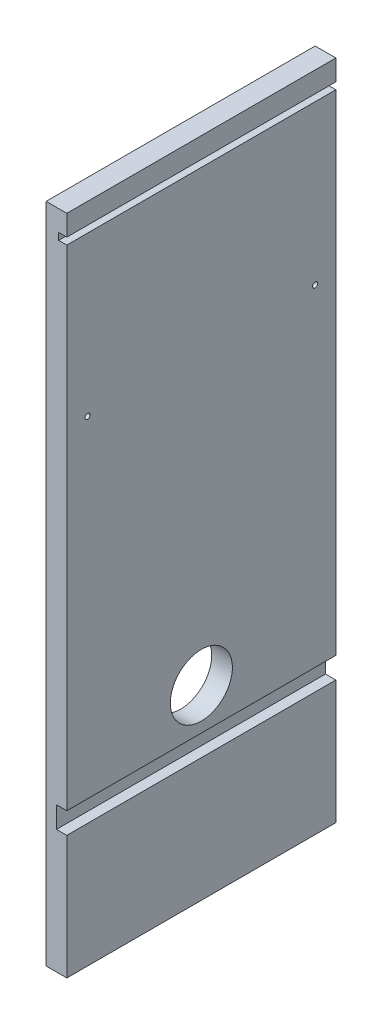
ISO-10303-21;
HEADER;
FILE_DESCRIPTION(('STEP AP214'),'2;1');
FILE_NAME('part.step','',(''),(''),'','','');
FILE_SCHEMA(('AUTOMOTIVE_DESIGN { 1 0 10303 214 1 1 1 1 }'));
ENDSEC;
DATA;
#1=APPLICATION_CONTEXT('core data for automotive mechanical design processes');
#2=APPLICATION_PROTOCOL_DEFINITION('international standard','automotive_design',2000,#1);
#3=PRODUCT_CONTEXT('',#1,'mechanical');
#4=PRODUCT('Part','Part','',(#3));
#5=PRODUCT_RELATED_PRODUCT_CATEGORY('part','',(#4));
#6=PRODUCT_DEFINITION_FORMATION('','',#4);
#7=PRODUCT_DEFINITION_CONTEXT('part definition',#1,'design');
#8=PRODUCT_DEFINITION('design','',#6,#7);
#9=PRODUCT_DEFINITION_SHAPE('','',#8);
#10=(LENGTH_UNIT() NAMED_UNIT(*) SI_UNIT(.MILLI.,.METRE.));
#11=(NAMED_UNIT(*) PLANE_ANGLE_UNIT() SI_UNIT($,.RADIAN.));
#12=(NAMED_UNIT(*) SI_UNIT($,.STERADIAN.) SOLID_ANGLE_UNIT());
#13=UNCERTAINTY_MEASURE_WITH_UNIT(LENGTH_MEASURE(1.E-05),#10,'distance_accuracy_value','');
#14=(GEOMETRIC_REPRESENTATION_CONTEXT(3) GLOBAL_UNCERTAINTY_ASSIGNED_CONTEXT((#13)) GLOBAL_UNIT_ASSIGNED_CONTEXT((#10,
#11,#12)) REPRESENTATION_CONTEXT('',''));
#15=CARTESIAN_POINT('',(0.,0.,0.));
#16=DIRECTION('',(0.,0.,1.));
#17=DIRECTION('',(1.,0.,0.));
#18=AXIS2_PLACEMENT_3D('',#15,#16,#17);
#19=CARTESIAN_POINT('',(-26.846079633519,0.,130.));
#20=DIRECTION('',(1.,0.,0.));
#21=DIRECTION('',(0.,1.,0.));
#22=AXIS2_PLACEMENT_3D('',#19,#20,#21);
#23=PLANE('',#22);
#24=CARTESIAN_POINT('',(-26.846079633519,-90.,120.));
#25=DIRECTION('',(-1.,0.,0.));
#26=DIRECTION('',(0.,-1.,0.));
#27=AXIS2_PLACEMENT_3D('',#24,#25,#26);
#28=CIRCLE('',#27,1.25000000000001);
#29=CARTESIAN_POINT('',(-26.846079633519,-91.25,120.));
#30=VERTEX_POINT('',#29);
#31=EDGE_CURVE('E276',#30,#30,#28,.T.);
#32=ORIENTED_EDGE('',*,*,#31,.F.);
#33=EDGE_LOOP('',(#32));
#34=FACE_BOUND('',#33,.T.);
#35=CARTESIAN_POINT('',(-26.846079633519,-90.,9.99999999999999));
#36=DIRECTION('',(-1.,0.,0.));
#37=DIRECTION('',(0.,-1.,0.));
#38=AXIS2_PLACEMENT_3D('',#35,#36,#37);
#39=CIRCLE('',#38,1.25);
#40=CARTESIAN_POINT('',(-26.846079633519,-91.25,9.99999999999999));
#41=VERTEX_POINT('',#40);
#42=EDGE_CURVE('E280',#41,#41,#39,.T.);
#43=ORIENTED_EDGE('',*,*,#42,.F.);
#44=EDGE_LOOP('',(#43));
#45=FACE_BOUND('',#44,.T.);
#46=CARTESIAN_POINT('',(-26.846079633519,-230.,65.));
#47=DIRECTION('',(-1.,0.,0.));
#48=DIRECTION('',(0.,-1.,0.));
#49=AXIS2_PLACEMENT_3D('',#46,#47,#48);
#50=CIRCLE('',#49,15.);
#51=CARTESIAN_POINT('',(-26.846079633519,-245.,65.));
#52=VERTEX_POINT('',#51);
#53=EDGE_CURVE('E144',#52,#52,#50,.T.);
#54=ORIENTED_EDGE('',*,*,#53,.F.);
#55=EDGE_LOOP('',(#54));
#56=FACE_BOUND('',#55,.T.);
#57=DIRECTION('',(0.,-1.,0.));
#58=VECTOR('',#57,1.);
#59=CARTESIAN_POINT('',(-26.846079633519,0.,0.));
#60=LINE('',#59,#58);
#61=CARTESIAN_POINT('',(-26.846079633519,0.,0.));
#62=VERTEX_POINT('',#61);
#63=CARTESIAN_POINT('',(-26.846079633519,-320.,0.));
#64=VERTEX_POINT('',#63);
#65=EDGE_CURVE('E127',#62,#64,#60,.T.);
#66=ORIENTED_EDGE('',*,*,#65,.T.);
#67=DIRECTION('',(0.,0.,-1.));
#68=VECTOR('',#67,1.);
#69=CARTESIAN_POINT('',(-26.846079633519,-320.,130.));
#70=LINE('',#69,#68);
#71=CARTESIAN_POINT('',(-26.846079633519,-320.,130.));
#72=VERTEX_POINT('',#71);
#73=EDGE_CURVE('E11',#72,#64,#70,.T.);
#74=ORIENTED_EDGE('',*,*,#73,.F.);
#75=DIRECTION('',(0.,-1.,0.));
#76=VECTOR('',#75,1.);
#77=CARTESIAN_POINT('',(-26.846079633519,0.,130.));
#78=LINE('',#77,#76);
#79=CARTESIAN_POINT('',(-26.846079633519,0.,130.));
#80=VERTEX_POINT('',#79);
#81=EDGE_CURVE('E167',#80,#72,#78,.T.);
#82=ORIENTED_EDGE('',*,*,#81,.F.);
#83=DIRECTION('',(0.,0.,-1.));
#84=VECTOR('',#83,1.);
#85=CARTESIAN_POINT('',(-26.846079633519,0.,130.));
#86=LINE('',#85,#84);
#87=EDGE_CURVE('E140',#80,#62,#86,.T.);
#88=ORIENTED_EDGE('',*,*,#87,.T.);
#89=EDGE_LOOP('',(#66,#74,#82,#88));
#90=FACE_BOUND('',#89,.T.);
#91=ADVANCED_FACE('F35',(#34,#45,#56,#90),#23,.F.);
#92=CARTESIAN_POINT('',(-26.846079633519,-320.,130.));
#93=DIRECTION('',(0.,1.,0.));
#94=DIRECTION('',(0.,0.,1.));
#95=AXIS2_PLACEMENT_3D('',#92,#93,#94);
#96=PLANE('',#95);
#97=CARTESIAN_POINT('',(-21.4686115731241,-320.,65.));
#98=DIRECTION('',(0.,-1.,0.));
#99=DIRECTION('',(0.,0.,-1.));
#100=AXIS2_PLACEMENT_3D('',#97,#98,#99);
#101=CIRCLE('',#100,2.5);
#102=CARTESIAN_POINT('',(-21.4686115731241,-320.,62.5));
#103=VERTEX_POINT('',#102);
#104=EDGE_CURVE('E296',#103,#103,#101,.T.);
#105=ORIENTED_EDGE('',*,*,#104,.F.);
#106=EDGE_LOOP('',(#105));
#107=FACE_BOUND('',#106,.T.);
#108=DIRECTION('',(1.,0.,0.));
#109=VECTOR('',#108,1.);
#110=CARTESIAN_POINT('',(-26.846079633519,-320.,0.));
#111=LINE('',#110,#109);
#112=CARTESIAN_POINT('',(-16.846079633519,-320.,0.));
#113=VERTEX_POINT('',#112);
#114=EDGE_CURVE('E123',#64,#113,#111,.T.);
#115=ORIENTED_EDGE('',*,*,#114,.T.);
#116=DIRECTION('',(0.,0.,-1.));
#117=VECTOR('',#116,1.);
#118=CARTESIAN_POINT('',(-16.846079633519,-320.,130.));
#119=LINE('',#118,#117);
#120=CARTESIAN_POINT('',(-16.846079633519,-320.,130.));
#121=VERTEX_POINT('',#120);
#122=EDGE_CURVE('E42',#121,#113,#119,.T.);
#123=ORIENTED_EDGE('',*,*,#122,.F.);
#124=DIRECTION('',(1.,0.,0.));
#125=VECTOR('',#124,1.);
#126=CARTESIAN_POINT('',(-26.846079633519,-320.,130.));
#127=LINE('',#126,#125);
#128=EDGE_CURVE('E136',#72,#121,#127,.T.);
#129=ORIENTED_EDGE('',*,*,#128,.F.);
#130=ORIENTED_EDGE('',*,*,#73,.T.);
#131=EDGE_LOOP('',(#115,#123,#129,#130));
#132=FACE_BOUND('',#131,.T.);
#133=ADVANCED_FACE('F135',(#107,#132),#96,.F.);
#134=CARTESIAN_POINT('',(-16.846079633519,-260.3,130.));
#135=DIRECTION('',(-1.,0.,0.));
#136=DIRECTION('',(0.,-1.,0.));
#137=AXIS2_PLACEMENT_3D('',#134,#135,#136);
#138=PLANE('',#137);
#139=DIRECTION('',(0.,1.,0.));
#140=VECTOR('',#139,1.);
#141=CARTESIAN_POINT('',(-16.846079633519,-260.3,0.));
#142=LINE('',#141,#140);
#143=CARTESIAN_POINT('',(-16.846079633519,-260.3,0.));
#144=VERTEX_POINT('',#143);
#145=EDGE_CURVE('E129',#113,#144,#142,.T.);
#146=ORIENTED_EDGE('',*,*,#145,.T.);
#147=DIRECTION('',(0.,0.,-1.));
#148=VECTOR('',#147,1.);
#149=CARTESIAN_POINT('',(-16.846079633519,-260.3,130.));
#150=LINE('',#149,#148);
#151=CARTESIAN_POINT('',(-16.846079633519,-260.3,130.));
#152=VERTEX_POINT('',#151);
#153=EDGE_CURVE('E213',#152,#144,#150,.T.);
#154=ORIENTED_EDGE('',*,*,#153,.F.);
#155=DIRECTION('',(0.,1.,0.));
#156=VECTOR('',#155,1.);
#157=CARTESIAN_POINT('',(-16.846079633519,-260.3,130.));
#158=LINE('',#157,#156);
#159=EDGE_CURVE('E170',#121,#152,#158,.T.);
#160=ORIENTED_EDGE('',*,*,#159,.F.);
#161=ORIENTED_EDGE('',*,*,#122,.T.);
#162=EDGE_LOOP('',(#146,#154,#160,#161));
#163=FACE_BOUND('',#162,.T.);
#164=ADVANCED_FACE('F217',(#163),#138,.F.);
#165=CARTESIAN_POINT('',(-16.846079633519,-260.3,130.));
#166=DIRECTION('',(0.,-1.,0.));
#167=DIRECTION('',(0.,0.,-1.));
#168=AXIS2_PLACEMENT_3D('',#165,#166,#167);
#169=PLANE('',#168);
#170=DIRECTION('',(-1.,0.,0.));
#171=VECTOR('',#170,1.);
#172=CARTESIAN_POINT('',(-16.846079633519,-260.3,0.));
#173=LINE('',#172,#171);
#174=CARTESIAN_POINT('',(-21.8460796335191,-260.3,0.));
#175=VERTEX_POINT('',#174);
#176=EDGE_CURVE('E149',#144,#175,#173,.T.);
#177=ORIENTED_EDGE('',*,*,#176,.T.);
#178=DIRECTION('',(0.,0.,-1.));
#179=VECTOR('',#178,1.);
#180=CARTESIAN_POINT('',(-21.8460796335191,-260.3,130.));
#181=LINE('',#180,#179);
#182=CARTESIAN_POINT('',(-21.8460796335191,-260.3,130.));
#183=VERTEX_POINT('',#182);
#184=EDGE_CURVE('E210',#183,#175,#181,.T.);
#185=ORIENTED_EDGE('',*,*,#184,.F.);
#186=DIRECTION('',(-1.,0.,0.));
#187=VECTOR('',#186,1.);
#188=CARTESIAN_POINT('',(-16.846079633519,-260.3,130.));
#189=LINE('',#188,#187);
#190=EDGE_CURVE('E172',#152,#183,#189,.T.);
#191=ORIENTED_EDGE('',*,*,#190,.F.);
#192=ORIENTED_EDGE('',*,*,#153,.T.);
#193=EDGE_LOOP('',(#177,#185,#191,#192));
#194=FACE_BOUND('',#193,.T.);
#195=ADVANCED_FACE('F225',(#194),#169,.F.);
#196=CARTESIAN_POINT('',(-21.8460796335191,-250.,130.));
#197=DIRECTION('',(-1.,0.,0.));
#198=DIRECTION('',(0.,0.,1.));
#199=AXIS2_PLACEMENT_3D('',#196,#197,#198);
#200=PLANE('',#199);
#201=DIRECTION('',(0.,1.,0.));
#202=VECTOR('',#201,1.);
#203=CARTESIAN_POINT('',(-21.8460796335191,-250.,0.));
#204=LINE('',#203,#202);
#205=CARTESIAN_POINT('',(-21.8460796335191,-250.,0.));
#206=VERTEX_POINT('',#205);
#207=EDGE_CURVE('E151',#175,#206,#204,.T.);
#208=ORIENTED_EDGE('',*,*,#207,.T.);
#209=DIRECTION('',(0.,0.,-1.));
#210=VECTOR('',#209,1.);
#211=CARTESIAN_POINT('',(-21.8460796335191,-250.,130.));
#212=LINE('',#211,#210);
#213=CARTESIAN_POINT('',(-21.8460796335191,-250.,130.));
#214=VERTEX_POINT('',#213);
#215=EDGE_CURVE('E207',#214,#206,#212,.T.);
#216=ORIENTED_EDGE('',*,*,#215,.F.);
#217=DIRECTION('',(0.,1.,0.));
#218=VECTOR('',#217,1.);
#219=CARTESIAN_POINT('',(-21.8460796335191,-250.,130.));
#220=LINE('',#219,#218);
#221=EDGE_CURVE('E174',#183,#214,#220,.T.);
#222=ORIENTED_EDGE('',*,*,#221,.F.);
#223=ORIENTED_EDGE('',*,*,#184,.T.);
#224=EDGE_LOOP('',(#208,#216,#222,#223));
#225=FACE_BOUND('',#224,.T.);
#226=ADVANCED_FACE('F228',(#225),#200,.F.);
#227=CARTESIAN_POINT('',(-16.8460796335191,-250.,130.));
#228=DIRECTION('',(0.,1.,0.));
#229=DIRECTION('',(0.,0.,1.));
#230=AXIS2_PLACEMENT_3D('',#227,#228,#229);
#231=PLANE('',#230);
#232=DIRECTION('',(1.,0.,0.));
#233=VECTOR('',#232,1.);
#234=CARTESIAN_POINT('',(-16.8460796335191,-250.,0.));
#235=LINE('',#234,#233);
#236=CARTESIAN_POINT('',(-16.8460796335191,-250.,0.));
#237=VERTEX_POINT('',#236);
#238=EDGE_CURVE('E153',#206,#237,#235,.T.);
#239=ORIENTED_EDGE('',*,*,#238,.T.);
#240=DIRECTION('',(0.,0.,-1.));
#241=VECTOR('',#240,1.);
#242=CARTESIAN_POINT('',(-16.8460796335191,-250.,130.));
#243=LINE('',#242,#241);
#244=CARTESIAN_POINT('',(-16.8460796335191,-250.,130.));
#245=VERTEX_POINT('',#244);
#246=EDGE_CURVE('E204',#245,#237,#243,.T.);
#247=ORIENTED_EDGE('',*,*,#246,.F.);
#248=DIRECTION('',(1.,0.,0.));
#249=VECTOR('',#248,1.);
#250=CARTESIAN_POINT('',(-16.8460796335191,-250.,130.));
#251=LINE('',#250,#249);
#252=EDGE_CURVE('E176',#214,#245,#251,.T.);
#253=ORIENTED_EDGE('',*,*,#252,.F.);
#254=ORIENTED_EDGE('',*,*,#215,.T.);
#255=EDGE_LOOP('',(#239,#247,#253,#254));
#256=FACE_BOUND('',#255,.T.);
#257=ADVANCED_FACE('F233',(#256),#231,.F.);
#258=CARTESIAN_POINT('',(-16.8460796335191,-13.3,130.));
#259=DIRECTION('',(-1.,0.,0.));
#260=DIRECTION('',(0.,-1.,0.));
#261=AXIS2_PLACEMENT_3D('',#258,#259,#260);
#262=PLANE('',#261);
#263=CARTESIAN_POINT('',(-16.846079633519,-90.,120.));
#264=DIRECTION('',(-1.,0.,0.));
#265=DIRECTION('',(0.,-1.,0.));
#266=AXIS2_PLACEMENT_3D('',#263,#264,#265);
#267=CIRCLE('',#266,1.25000000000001);
#268=CARTESIAN_POINT('',(-16.846079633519,-91.25,120.));
#269=VERTEX_POINT('',#268);
#270=EDGE_CURVE('E289',#269,#269,#267,.T.);
#271=ORIENTED_EDGE('',*,*,#270,.T.);
#272=EDGE_LOOP('',(#271));
#273=FACE_BOUND('',#272,.T.);
#274=CARTESIAN_POINT('',(-16.846079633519,-90.,9.99999999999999));
#275=DIRECTION('',(-1.,0.,0.));
#276=DIRECTION('',(0.,-1.,0.));
#277=AXIS2_PLACEMENT_3D('',#274,#275,#276);
#278=CIRCLE('',#277,1.25);
#279=CARTESIAN_POINT('',(-16.846079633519,-91.25,9.99999999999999));
#280=VERTEX_POINT('',#279);
#281=EDGE_CURVE('E284',#280,#280,#278,.T.);
#282=ORIENTED_EDGE('',*,*,#281,.T.);
#283=EDGE_LOOP('',(#282));
#284=FACE_BOUND('',#283,.T.);
#285=CARTESIAN_POINT('',(-16.846079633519,-230.,65.));
#286=DIRECTION('',(-1.,0.,0.));
#287=DIRECTION('',(0.,-1.,0.));
#288=AXIS2_PLACEMENT_3D('',#285,#286,#287);
#289=CIRCLE('',#288,15.);
#290=CARTESIAN_POINT('',(-16.846079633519,-245.,65.));
#291=VERTEX_POINT('',#290);
#292=EDGE_CURVE('E141',#291,#291,#289,.T.);
#293=ORIENTED_EDGE('',*,*,#292,.T.);
#294=EDGE_LOOP('',(#293));
#295=FACE_BOUND('',#294,.T.);
#296=DIRECTION('',(0.,1.,0.));
#297=VECTOR('',#296,1.);
#298=CARTESIAN_POINT('',(-16.8460796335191,-13.3,0.));
#299=LINE('',#298,#297);
#300=CARTESIAN_POINT('',(-16.8460796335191,-13.3,0.));
#301=VERTEX_POINT('',#300);
#302=EDGE_CURVE('E155',#237,#301,#299,.T.);
#303=ORIENTED_EDGE('',*,*,#302,.T.);
#304=DIRECTION('',(0.,0.,-1.));
#305=VECTOR('',#304,1.);
#306=CARTESIAN_POINT('',(-16.8460796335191,-13.3,130.));
#307=LINE('',#306,#305);
#308=CARTESIAN_POINT('',(-16.8460796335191,-13.3,130.));
#309=VERTEX_POINT('',#308);
#310=EDGE_CURVE('E201',#309,#301,#307,.T.);
#311=ORIENTED_EDGE('',*,*,#310,.F.);
#312=DIRECTION('',(0.,1.,0.));
#313=VECTOR('',#312,1.);
#314=CARTESIAN_POINT('',(-16.8460796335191,-13.3,130.));
#315=LINE('',#314,#313);
#316=EDGE_CURVE('E178',#245,#309,#315,.T.);
#317=ORIENTED_EDGE('',*,*,#316,.F.);
#318=ORIENTED_EDGE('',*,*,#246,.T.);
#319=EDGE_LOOP('',(#303,#311,#317,#318));
#320=FACE_BOUND('',#319,.T.);
#321=ADVANCED_FACE('F239',(#273,#284,#295,#320),#262,.F.);
#322=CARTESIAN_POINT('',(-20.7739022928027,-13.3,130.));
#323=DIRECTION('',(0.,-1.,0.));
#324=DIRECTION('',(0.,0.,-1.));
#325=AXIS2_PLACEMENT_3D('',#322,#323,#324);
#326=PLANE('',#325);
#327=DIRECTION('',(-1.,0.,0.));
#328=VECTOR('',#327,1.);
#329=CARTESIAN_POINT('',(-20.7739022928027,-13.3,0.));
#330=LINE('',#329,#328);
#331=CARTESIAN_POINT('',(-20.7739022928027,-13.3,0.));
#332=VERTEX_POINT('',#331);
#333=EDGE_CURVE('E157',#301,#332,#330,.T.);
#334=ORIENTED_EDGE('',*,*,#333,.T.);
#335=DIRECTION('',(0.,0.,-1.));
#336=VECTOR('',#335,1.);
#337=CARTESIAN_POINT('',(-20.7739022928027,-13.3,130.));
#338=LINE('',#337,#336);
#339=CARTESIAN_POINT('',(-20.7739022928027,-13.3,130.));
#340=VERTEX_POINT('',#339);
#341=EDGE_CURVE('E198',#340,#332,#338,.T.);
#342=ORIENTED_EDGE('',*,*,#341,.F.);
#343=DIRECTION('',(-1.,0.,0.));
#344=VECTOR('',#343,1.);
#345=CARTESIAN_POINT('',(-20.7739022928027,-13.3,130.));
#346=LINE('',#345,#344);
#347=EDGE_CURVE('E180',#309,#340,#346,.T.);
#348=ORIENTED_EDGE('',*,*,#347,.F.);
#349=ORIENTED_EDGE('',*,*,#310,.T.);
#350=EDGE_LOOP('',(#334,#342,#348,#349));
#351=FACE_BOUND('',#350,.T.);
#352=ADVANCED_FACE('F243',(#351),#326,.F.);
#353=CARTESIAN_POINT('',(-20.7739022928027,-10.,130.));
#354=DIRECTION('',(-1.,0.,0.));
#355=DIRECTION('',(0.,0.,1.));
#356=AXIS2_PLACEMENT_3D('',#353,#354,#355);
#357=PLANE('',#356);
#358=DIRECTION('',(0.,1.,0.));
#359=VECTOR('',#358,1.);
#360=CARTESIAN_POINT('',(-20.7739022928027,-10.,0.));
#361=LINE('',#360,#359);
#362=CARTESIAN_POINT('',(-20.7739022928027,-10.,0.));
#363=VERTEX_POINT('',#362);
#364=EDGE_CURVE('E159',#332,#363,#361,.T.);
#365=ORIENTED_EDGE('',*,*,#364,.T.);
#366=DIRECTION('',(0.,0.,-1.));
#367=VECTOR('',#366,1.);
#368=CARTESIAN_POINT('',(-20.7739022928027,-10.,130.));
#369=LINE('',#368,#367);
#370=CARTESIAN_POINT('',(-20.7739022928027,-10.,130.));
#371=VERTEX_POINT('',#370);
#372=EDGE_CURVE('E195',#371,#363,#369,.T.);
#373=ORIENTED_EDGE('',*,*,#372,.F.);
#374=DIRECTION('',(0.,1.,0.));
#375=VECTOR('',#374,1.);
#376=CARTESIAN_POINT('',(-20.7739022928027,-10.,130.));
#377=LINE('',#376,#375);
#378=EDGE_CURVE('E182',#340,#371,#377,.T.);
#379=ORIENTED_EDGE('',*,*,#378,.F.);
#380=ORIENTED_EDGE('',*,*,#341,.T.);
#381=EDGE_LOOP('',(#365,#373,#379,#380));
#382=FACE_BOUND('',#381,.T.);
#383=ADVANCED_FACE('F248',(#382),#357,.F.);
#384=CARTESIAN_POINT('',(-20.7739022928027,-10.,130.));
#385=DIRECTION('',(0.,1.,0.));
#386=DIRECTION('',(0.,0.,1.));
#387=AXIS2_PLACEMENT_3D('',#384,#385,#386);
#388=PLANE('',#387);
#389=DIRECTION('',(1.,0.,0.));
#390=VECTOR('',#389,1.);
#391=CARTESIAN_POINT('',(-20.7739022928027,-10.,0.));
#392=LINE('',#391,#390);
#393=CARTESIAN_POINT('',(-16.846079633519,-10.,0.));
#394=VERTEX_POINT('',#393);
#395=EDGE_CURVE('E161',#363,#394,#392,.T.);
#396=ORIENTED_EDGE('',*,*,#395,.T.);
#397=DIRECTION('',(0.,0.,-1.));
#398=VECTOR('',#397,1.);
#399=CARTESIAN_POINT('',(-16.846079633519,-10.,130.));
#400=LINE('',#399,#398);
#401=CARTESIAN_POINT('',(-16.846079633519,-10.,130.));
#402=VERTEX_POINT('',#401);
#403=EDGE_CURVE('E192',#402,#394,#400,.T.);
#404=ORIENTED_EDGE('',*,*,#403,.F.);
#405=DIRECTION('',(1.,0.,0.));
#406=VECTOR('',#405,1.);
#407=CARTESIAN_POINT('',(-20.7739022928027,-10.,130.));
#408=LINE('',#407,#406);
#409=EDGE_CURVE('E184',#371,#402,#408,.T.);
#410=ORIENTED_EDGE('',*,*,#409,.F.);
#411=ORIENTED_EDGE('',*,*,#372,.T.);
#412=EDGE_LOOP('',(#396,#404,#410,#411));
#413=FACE_BOUND('',#412,.T.);
#414=ADVANCED_FACE('F252',(#413),#388,.F.);
#415=CARTESIAN_POINT('',(-16.8460796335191,0.,130.));
#416=DIRECTION('',(-1.,0.,0.));
#417=DIRECTION('',(0.,-1.,0.));
#418=AXIS2_PLACEMENT_3D('',#415,#416,#417);
#419=PLANE('',#418);
#420=DIRECTION('',(0.,1.,0.));
#421=VECTOR('',#420,1.);
#422=CARTESIAN_POINT('',(-16.8460796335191,0.,0.));
#423=LINE('',#422,#421);
#424=CARTESIAN_POINT('',(-16.8460796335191,0.,0.));
#425=VERTEX_POINT('',#424);
#426=EDGE_CURVE('E163',#394,#425,#423,.T.);
#427=ORIENTED_EDGE('',*,*,#426,.T.);
#428=DIRECTION('',(0.,0.,-1.));
#429=VECTOR('',#428,1.);
#430=CARTESIAN_POINT('',(-16.8460796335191,0.,130.));
#431=LINE('',#430,#429);
#432=CARTESIAN_POINT('',(-16.8460796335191,0.,130.));
#433=VERTEX_POINT('',#432);
#434=EDGE_CURVE('E189',#433,#425,#431,.T.);
#435=ORIENTED_EDGE('',*,*,#434,.F.);
#436=DIRECTION('',(0.,1.,0.));
#437=VECTOR('',#436,1.);
#438=CARTESIAN_POINT('',(-16.8460796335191,0.,130.));
#439=LINE('',#438,#437);
#440=EDGE_CURVE('E54',#402,#433,#439,.T.);
#441=ORIENTED_EDGE('',*,*,#440,.F.);
#442=ORIENTED_EDGE('',*,*,#403,.T.);
#443=EDGE_LOOP('',(#427,#435,#441,#442));
#444=FACE_BOUND('',#443,.T.);
#445=ADVANCED_FACE('F256',(#444),#419,.F.);
#446=CARTESIAN_POINT('',(-26.846079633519,0.,130.));
#447=DIRECTION('',(0.,-1.,0.));
#448=DIRECTION('',(1.,0.,0.));
#449=AXIS2_PLACEMENT_3D('',#446,#447,#448);
#450=PLANE('',#449);
#451=DIRECTION('',(-1.,0.,0.));
#452=VECTOR('',#451,1.);
#453=CARTESIAN_POINT('',(-26.846079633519,0.,0.));
#454=LINE('',#453,#452);
#455=EDGE_CURVE('E165',#425,#62,#454,.T.);
#456=ORIENTED_EDGE('',*,*,#455,.T.);
#457=ORIENTED_EDGE('',*,*,#87,.F.);
#458=DIRECTION('',(-1.,0.,0.));
#459=VECTOR('',#458,1.);
#460=CARTESIAN_POINT('',(-26.846079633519,0.,130.));
#461=LINE('',#460,#459);
#462=EDGE_CURVE('E49',#433,#80,#461,.T.);
#463=ORIENTED_EDGE('',*,*,#462,.F.);
#464=ORIENTED_EDGE('',*,*,#434,.T.);
#465=EDGE_LOOP('',(#456,#457,#463,#464));
#466=FACE_BOUND('',#465,.T.);
#467=ADVANCED_FACE('F258',(#466),#450,.F.);
#468=CARTESIAN_POINT('',(-26.846079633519,-320.,130.));
#469=DIRECTION('',(0.,0.,1.));
#470=DIRECTION('',(1.,0.,0.));
#471=AXIS2_PLACEMENT_3D('',#468,#469,#470);
#472=PLANE('',#471);
#473=ORIENTED_EDGE('',*,*,#81,.T.);
#474=ORIENTED_EDGE('',*,*,#128,.T.);
#475=ORIENTED_EDGE('',*,*,#159,.T.);
#476=ORIENTED_EDGE('',*,*,#190,.T.);
#477=ORIENTED_EDGE('',*,*,#221,.T.);
#478=ORIENTED_EDGE('',*,*,#252,.T.);
#479=ORIENTED_EDGE('',*,*,#316,.T.);
#480=ORIENTED_EDGE('',*,*,#347,.T.);
#481=ORIENTED_EDGE('',*,*,#378,.T.);
#482=ORIENTED_EDGE('',*,*,#409,.T.);
#483=ORIENTED_EDGE('',*,*,#440,.T.);
#484=ORIENTED_EDGE('',*,*,#462,.T.);
#485=EDGE_LOOP('',(#473,#474,#475,#476,#477,#478,#479,#480,#481,#482,#483,#484));
#486=FACE_BOUND('',#485,.T.);
#487=ADVANCED_FACE('F220',(#486),#472,.T.);
#488=CARTESIAN_POINT('',(-26.846079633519,-320.,0.));
#489=DIRECTION('',(0.,0.,1.));
#490=DIRECTION('',(1.,0.,0.));
#491=AXIS2_PLACEMENT_3D('',#488,#489,#490);
#492=PLANE('',#491);
#493=ORIENTED_EDGE('',*,*,#65,.F.);
#494=ORIENTED_EDGE('',*,*,#455,.F.);
#495=ORIENTED_EDGE('',*,*,#426,.F.);
#496=ORIENTED_EDGE('',*,*,#395,.F.);
#497=ORIENTED_EDGE('',*,*,#364,.F.);
#498=ORIENTED_EDGE('',*,*,#333,.F.);
#499=ORIENTED_EDGE('',*,*,#302,.F.);
#500=ORIENTED_EDGE('',*,*,#238,.F.);
#501=ORIENTED_EDGE('',*,*,#207,.F.);
#502=ORIENTED_EDGE('',*,*,#176,.F.);
#503=ORIENTED_EDGE('',*,*,#145,.F.);
#504=ORIENTED_EDGE('',*,*,#114,.F.);
#505=EDGE_LOOP('',(#493,#494,#495,#496,#497,#498,#499,#500,#501,#502,#503,#504));
#506=FACE_BOUND('',#505,.T.);
#507=ADVANCED_FACE('F124',(#506),#492,.F.);
#508=CARTESIAN_POINT('',(-16.846079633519,-230.,65.));
#509=DIRECTION('',(-1.,0.,0.));
#510=DIRECTION('',(0.,-1.,0.));
#511=AXIS2_PLACEMENT_3D('',#508,#509,#510);
#512=CYLINDRICAL_SURFACE('',#511,15.);
#513=ORIENTED_EDGE('',*,*,#292,.F.);
#514=EDGE_LOOP('',(#513));
#515=FACE_BOUND('',#514,.T.);
#516=ORIENTED_EDGE('',*,*,#53,.T.);
#517=EDGE_LOOP('',(#516));
#518=FACE_BOUND('',#517,.T.);
#519=ADVANCED_FACE('F319',(#515,#518),#512,.F.);
#520=CARTESIAN_POINT('',(-16.846079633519,-90.,9.99999999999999));
#521=DIRECTION('',(-1.,0.,0.));
#522=DIRECTION('',(0.,-1.,0.));
#523=AXIS2_PLACEMENT_3D('',#520,#521,#522);
#524=CYLINDRICAL_SURFACE('',#523,1.25);
#525=ORIENTED_EDGE('',*,*,#281,.F.);
#526=EDGE_LOOP('',(#525));
#527=FACE_BOUND('',#526,.T.);
#528=ORIENTED_EDGE('',*,*,#42,.T.);
#529=EDGE_LOOP('',(#528));
#530=FACE_BOUND('',#529,.T.);
#531=ADVANCED_FACE('F312',(#527,#530),#524,.F.);
#532=CARTESIAN_POINT('',(-16.846079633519,-90.,120.));
#533=DIRECTION('',(-1.,0.,0.));
#534=DIRECTION('',(0.,-1.,0.));
#535=AXIS2_PLACEMENT_3D('',#532,#533,#534);
#536=CYLINDRICAL_SURFACE('',#535,1.25000000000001);
#537=ORIENTED_EDGE('',*,*,#270,.F.);
#538=EDGE_LOOP('',(#537));
#539=FACE_BOUND('',#538,.T.);
#540=ORIENTED_EDGE('',*,*,#31,.T.);
#541=EDGE_LOOP('',(#540));
#542=FACE_BOUND('',#541,.T.);
#543=ADVANCED_FACE('F303',(#539,#542),#536,.F.);
#544=CARTESIAN_POINT('',(-21.4686115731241,-312.,65.));
#545=DIRECTION('',(0.,-1.,0.));
#546=DIRECTION('',(0.,0.,-1.));
#547=AXIS2_PLACEMENT_3D('',#544,#545,#546);
#548=CYLINDRICAL_SURFACE('',#547,2.5);
#549=CARTESIAN_POINT('',(-21.4686115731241,-312.,65.));
#550=DIRECTION('',(0.,-1.,0.));
#551=DIRECTION('',(0.,0.,-1.));
#552=AXIS2_PLACEMENT_3D('',#549,#550,#551);
#553=CIRCLE('',#552,2.5);
#554=CARTESIAN_POINT('',(-21.4686115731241,-312.,62.5));
#555=VERTEX_POINT('',#554);
#556=EDGE_CURVE('E293',#555,#555,#553,.T.);
#557=ORIENTED_EDGE('',*,*,#556,.F.);
#558=EDGE_LOOP('',(#557));
#559=FACE_BOUND('',#558,.T.);
#560=ORIENTED_EDGE('',*,*,#104,.T.);
#561=EDGE_LOOP('',(#560));
#562=FACE_BOUND('',#561,.T.);
#563=ADVANCED_FACE('F300',(#559,#562),#548,.F.);
#564=CARTESIAN_POINT('',(-21.4686115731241,-312.,65.));
#565=DIRECTION('',(0.,-1.,0.));
#566=DIRECTION('',(0.,0.,-1.));
#567=AXIS2_PLACEMENT_3D('',#564,#565,#566);
#568=PLANE('',#567);
#569=ORIENTED_EDGE('',*,*,#556,.T.);
#570=EDGE_LOOP('',(#569));
#571=FACE_BOUND('',#570,.T.);
#572=ADVANCED_FACE('F302',(#571),#568,.T.);
#573=CLOSED_SHELL('',(#91,#133,#164,#195,#226,#257,#321,#352,#383,#414,#445,#467,#487,#507,#519,
#531,#543,#563,#572));
#574=MANIFOLD_SOLID_BREP('B2',#573);
#575=ADVANCED_BREP_SHAPE_REPRESENTATION('',(#18,#574),#14);
#576=SHAPE_DEFINITION_REPRESENTATION(#9,#575);
ENDSEC;
END-ISO-10303-21;
